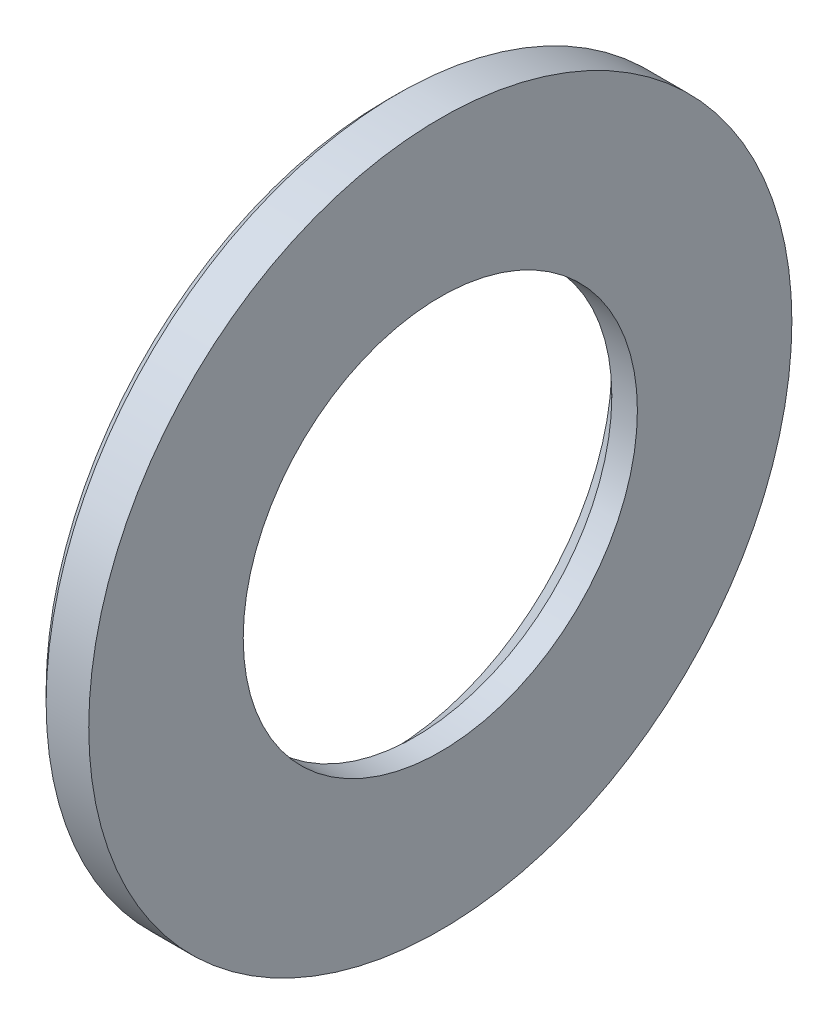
from build123d import *


with BuildPart() as part:
    # Sketch1 → Base-Revolve (revolve)
    with BuildSketch(Plane.XY, mode=Mode.PRIVATE) as base_revolve_sk:
        Polygon((0, 18.5), (0, 33), (-4, 33), (-5, 32), (-5, 21.1), (-2.4, 18.5), align=None)
    revolve(base_revolve_sk.sketch.rotate(Axis((-34.925, 0, 0), (1, 0, 0)), 90), axis=Axis((-34.925, 0, 0), (1, 0, 0)))


solid = part.part
